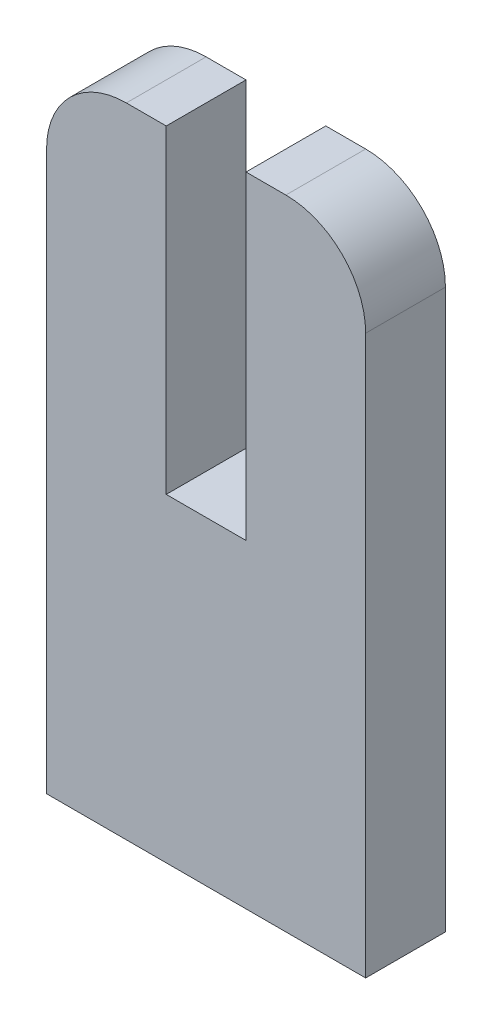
ISO-10303-21;
HEADER;
FILE_DESCRIPTION(('STEP AP214'),'2;1');
FILE_NAME('part.step','',(''),(''),'','','');
FILE_SCHEMA(('AUTOMOTIVE_DESIGN { 1 0 10303 214 1 1 1 1 }'));
ENDSEC;
DATA;
#1=APPLICATION_CONTEXT('core data for automotive mechanical design processes');
#2=APPLICATION_PROTOCOL_DEFINITION('international standard','automotive_design',2000,#1);
#3=PRODUCT_CONTEXT('',#1,'mechanical');
#4=PRODUCT('Part','Part','',(#3));
#5=PRODUCT_RELATED_PRODUCT_CATEGORY('part','',(#4));
#6=PRODUCT_DEFINITION_FORMATION('','',#4);
#7=PRODUCT_DEFINITION_CONTEXT('part definition',#1,'design');
#8=PRODUCT_DEFINITION('design','',#6,#7);
#9=PRODUCT_DEFINITION_SHAPE('','',#8);
#10=(LENGTH_UNIT() NAMED_UNIT(*) SI_UNIT(.MILLI.,.METRE.));
#11=(NAMED_UNIT(*) PLANE_ANGLE_UNIT() SI_UNIT($,.RADIAN.));
#12=(NAMED_UNIT(*) SI_UNIT($,.STERADIAN.) SOLID_ANGLE_UNIT());
#13=UNCERTAINTY_MEASURE_WITH_UNIT(LENGTH_MEASURE(1.E-05),#10,'distance_accuracy_value','');
#14=(GEOMETRIC_REPRESENTATION_CONTEXT(3) GLOBAL_UNCERTAINTY_ASSIGNED_CONTEXT((#13)) GLOBAL_UNIT_ASSIGNED_CONTEXT((#10,
#11,#12)) REPRESENTATION_CONTEXT('',''));
#15=CARTESIAN_POINT('',(0.,0.,0.));
#16=DIRECTION('',(0.,0.,1.));
#17=DIRECTION('',(1.,0.,0.));
#18=AXIS2_PLACEMENT_3D('',#15,#16,#17);
#19=CARTESIAN_POINT('',(-6.35,12.7,1.5875));
#20=DIRECTION('',(0.,-1.,0.));
#21=DIRECTION('',(0.,0.,-1.));
#22=AXIS2_PLACEMENT_3D('',#19,#20,#21);
#23=PLANE('',#22);
#24=DIRECTION('',(-1.,0.,0.));
#25=VECTOR('',#24,1.);
#26=CARTESIAN_POINT('',(-6.35,12.7,-1.5875));
#27=LINE('',#26,#25);
#28=CARTESIAN_POINT('',(-1.5875,12.7,-1.5875));
#29=VERTEX_POINT('',#28);
#30=CARTESIAN_POINT('',(-3.175,12.7,-1.5875));
#31=VERTEX_POINT('',#30);
#32=EDGE_CURVE('E131',#29,#31,#27,.T.);
#33=ORIENTED_EDGE('',*,*,#32,.T.);
#34=DIRECTION('',(0.,0.,-1.));
#35=VECTOR('',#34,1.);
#36=CARTESIAN_POINT('',(-3.175,12.7,1.5875));
#37=LINE('',#36,#35);
#38=CARTESIAN_POINT('',(-3.175,12.7,1.5875));
#39=VERTEX_POINT('',#38);
#40=EDGE_CURVE('E11',#31,#39,#37,.F.);
#41=ORIENTED_EDGE('',*,*,#40,.T.);
#42=DIRECTION('',(-1.,0.,0.));
#43=VECTOR('',#42,1.);
#44=CARTESIAN_POINT('',(-6.35,12.7,1.5875));
#45=LINE('',#44,#43);
#46=CARTESIAN_POINT('',(-1.5875,12.7,1.5875));
#47=VERTEX_POINT('',#46);
#48=EDGE_CURVE('E151',#47,#39,#45,.T.);
#49=ORIENTED_EDGE('',*,*,#48,.F.);
#50=DIRECTION('',(0.,0.,1.));
#51=VECTOR('',#50,1.);
#52=CARTESIAN_POINT('',(-1.5875,12.7,-1.5875));
#53=LINE('',#52,#51);
#54=EDGE_CURVE('E141',#29,#47,#53,.T.);
#55=ORIENTED_EDGE('',*,*,#54,.F.);
#56=EDGE_LOOP('',(#33,#41,#49,#55));
#57=FACE_BOUND('',#56,.T.);
#58=ADVANCED_FACE('F31',(#57),#23,.F.);
#59=CARTESIAN_POINT('',(6.35,12.7,1.5875));
#60=DIRECTION('',(-1.,0.,0.));
#61=DIRECTION('',(0.,-1.,0.));
#62=AXIS2_PLACEMENT_3D('',#59,#60,#61);
#63=PLANE('',#62);
#64=DIRECTION('',(0.,1.,0.));
#65=VECTOR('',#64,1.);
#66=CARTESIAN_POINT('',(6.35,12.7,-1.5875));
#67=LINE('',#66,#65);
#68=CARTESIAN_POINT('',(6.35,-12.7,-1.5875));
#69=VERTEX_POINT('',#68);
#70=CARTESIAN_POINT('',(6.35,9.52499999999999,-1.5875));
#71=VERTEX_POINT('',#70);
#72=EDGE_CURVE('E143',#69,#71,#67,.T.);
#73=ORIENTED_EDGE('',*,*,#72,.T.);
#74=DIRECTION('',(0.,0.,-1.));
#75=VECTOR('',#74,1.);
#76=CARTESIAN_POINT('',(6.35,9.52499999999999,1.5875));
#77=LINE('',#76,#75);
#78=CARTESIAN_POINT('',(6.35,9.52499999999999,1.5875));
#79=VERTEX_POINT('',#78);
#80=EDGE_CURVE('E179',#71,#79,#77,.F.);
#81=ORIENTED_EDGE('',*,*,#80,.T.);
#82=DIRECTION('',(0.,1.,0.));
#83=VECTOR('',#82,1.);
#84=CARTESIAN_POINT('',(6.35,12.7,1.5875));
#85=LINE('',#84,#83);
#86=CARTESIAN_POINT('',(6.35,-12.7,1.5875));
#87=VERTEX_POINT('',#86);
#88=EDGE_CURVE('E148',#87,#79,#85,.T.);
#89=ORIENTED_EDGE('',*,*,#88,.F.);
#90=DIRECTION('',(0.,0.,-1.));
#91=VECTOR('',#90,1.);
#92=CARTESIAN_POINT('',(6.35,-12.7,1.5875));
#93=LINE('',#92,#91);
#94=EDGE_CURVE('E159',#87,#69,#93,.T.);
#95=ORIENTED_EDGE('',*,*,#94,.T.);
#96=EDGE_LOOP('',(#73,#81,#89,#95));
#97=FACE_BOUND('',#96,.T.);
#98=ADVANCED_FACE('F198',(#97),#63,.F.);
#99=CARTESIAN_POINT('',(3.175,12.7,1.5875));
#100=VERTEX_POINT('',#99);
#101=CARTESIAN_POINT('',(1.5875,12.7,1.5875));
#102=VERTEX_POINT('',#101);
#103=EDGE_CURVE('E153',#100,#102,#45,.T.);
#104=ORIENTED_EDGE('',*,*,#103,.F.);
#105=DIRECTION('',(0.,0.,-1.));
#106=VECTOR('',#105,1.);
#107=CARTESIAN_POINT('',(3.175,12.7,1.5875));
#108=LINE('',#107,#106);
#109=CARTESIAN_POINT('',(3.175,12.7,-1.5875));
#110=VERTEX_POINT('',#109);
#111=EDGE_CURVE('E172',#100,#110,#108,.T.);
#112=ORIENTED_EDGE('',*,*,#111,.T.);
#113=CARTESIAN_POINT('',(1.5875,12.7,-1.5875));
#114=VERTEX_POINT('',#113);
#115=EDGE_CURVE('E162',#110,#114,#27,.T.);
#116=ORIENTED_EDGE('',*,*,#115,.T.);
#117=DIRECTION('',(0.,0.,1.));
#118=VECTOR('',#117,1.);
#119=CARTESIAN_POINT('',(1.5875,12.7,-1.5875));
#120=LINE('',#119,#118);
#121=EDGE_CURVE('E144',#114,#102,#120,.T.);
#122=ORIENTED_EDGE('',*,*,#121,.T.);
#123=EDGE_LOOP('',(#104,#112,#116,#122));
#124=FACE_BOUND('',#123,.T.);
#125=ADVANCED_FACE('F207',(#124),#23,.F.);
#126=CARTESIAN_POINT('',(-6.35,12.7,1.5875));
#127=DIRECTION('',(1.,0.,0.));
#128=DIRECTION('',(0.,1.,0.));
#129=AXIS2_PLACEMENT_3D('',#126,#127,#128);
#130=PLANE('',#129);
#131=DIRECTION('',(0.,-1.,0.));
#132=VECTOR('',#131,1.);
#133=CARTESIAN_POINT('',(-6.35,12.7,1.5875));
#134=LINE('',#133,#132);
#135=CARTESIAN_POINT('',(-6.35,9.52499999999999,1.5875));
#136=VERTEX_POINT('',#135);
#137=CARTESIAN_POINT('',(-6.35,-12.7,1.5875));
#138=VERTEX_POINT('',#137);
#139=EDGE_CURVE('E155',#136,#138,#134,.T.);
#140=ORIENTED_EDGE('',*,*,#139,.F.);
#141=DIRECTION('',(0.,0.,-1.));
#142=VECTOR('',#141,1.);
#143=CARTESIAN_POINT('',(-6.35,9.52499999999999,1.5875));
#144=LINE('',#143,#142);
#145=CARTESIAN_POINT('',(-6.35,9.52499999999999,-1.5875));
#146=VERTEX_POINT('',#145);
#147=EDGE_CURVE('E39',#136,#146,#144,.T.);
#148=ORIENTED_EDGE('',*,*,#147,.T.);
#149=DIRECTION('',(0.,-1.,0.));
#150=VECTOR('',#149,1.);
#151=CARTESIAN_POINT('',(-6.35,12.7,-1.5875));
#152=LINE('',#151,#150);
#153=CARTESIAN_POINT('',(-6.35,-12.7,-1.5875));
#154=VERTEX_POINT('',#153);
#155=EDGE_CURVE('E164',#146,#154,#152,.T.);
#156=ORIENTED_EDGE('',*,*,#155,.T.);
#157=DIRECTION('',(0.,0.,-1.));
#158=VECTOR('',#157,1.);
#159=CARTESIAN_POINT('',(-6.35,-12.7,1.5875));
#160=LINE('',#159,#158);
#161=EDGE_CURVE('E169',#138,#154,#160,.T.);
#162=ORIENTED_EDGE('',*,*,#161,.F.);
#163=EDGE_LOOP('',(#140,#148,#156,#162));
#164=FACE_BOUND('',#163,.T.);
#165=ADVANCED_FACE('F187',(#164),#130,.F.);
#166=CARTESIAN_POINT('',(-6.35,-12.7,1.5875));
#167=DIRECTION('',(0.,1.,0.));
#168=DIRECTION('',(0.,0.,1.));
#169=AXIS2_PLACEMENT_3D('',#166,#167,#168);
#170=PLANE('',#169);
#171=DIRECTION('',(1.,0.,0.));
#172=VECTOR('',#171,1.);
#173=CARTESIAN_POINT('',(-6.35,-12.7,-1.5875));
#174=LINE('',#173,#172);
#175=EDGE_CURVE('E152',#154,#69,#174,.T.);
#176=ORIENTED_EDGE('',*,*,#175,.T.);
#177=ORIENTED_EDGE('',*,*,#94,.F.);
#178=DIRECTION('',(1.,0.,0.));
#179=VECTOR('',#178,1.);
#180=CARTESIAN_POINT('',(-6.35,-12.7,1.5875));
#181=LINE('',#180,#179);
#182=EDGE_CURVE('E157',#138,#87,#181,.T.);
#183=ORIENTED_EDGE('',*,*,#182,.F.);
#184=ORIENTED_EDGE('',*,*,#161,.T.);
#185=EDGE_LOOP('',(#176,#177,#183,#184));
#186=FACE_BOUND('',#185,.T.);
#187=ADVANCED_FACE('F194',(#186),#170,.F.);
#188=CARTESIAN_POINT('',(6.35,-12.7,1.5875));
#189=DIRECTION('',(0.,0.,1.));
#190=DIRECTION('',(1.,0.,0.));
#191=AXIS2_PLACEMENT_3D('',#188,#189,#190);
#192=PLANE('',#191);
#193=ORIENTED_EDGE('',*,*,#88,.T.);
#194=CARTESIAN_POINT('',(3.175,9.52499999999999,1.5875));
#195=DIRECTION('',(0.,0.,1.));
#196=DIRECTION('',(1.,0.,0.));
#197=AXIS2_PLACEMENT_3D('',#194,#195,#196);
#198=CIRCLE('',#197,3.175);
#199=EDGE_CURVE('E182',#79,#100,#198,.T.);
#200=ORIENTED_EDGE('',*,*,#199,.T.);
#201=ORIENTED_EDGE('',*,*,#103,.T.);
#202=DIRECTION('',(0.,1.,0.));
#203=VECTOR('',#202,1.);
#204=CARTESIAN_POINT('',(1.5875,12.7,1.5875));
#205=LINE('',#204,#203);
#206=CARTESIAN_POINT('',(1.5875,0.,1.5875));
#207=VERTEX_POINT('',#206);
#208=EDGE_CURVE('E132',#207,#102,#205,.T.);
#209=ORIENTED_EDGE('',*,*,#208,.F.);
#210=DIRECTION('',(1.,0.,0.));
#211=VECTOR('',#210,1.);
#212=CARTESIAN_POINT('',(-1.5875,0.,1.5875));
#213=LINE('',#212,#211);
#214=CARTESIAN_POINT('',(-1.5875,0.,1.5875));
#215=VERTEX_POINT('',#214);
#216=EDGE_CURVE('E135',#215,#207,#213,.T.);
#217=ORIENTED_EDGE('',*,*,#216,.F.);
#218=DIRECTION('',(0.,-1.,0.));
#219=VECTOR('',#218,1.);
#220=CARTESIAN_POINT('',(-1.5875,12.7,1.5875));
#221=LINE('',#220,#219);
#222=EDGE_CURVE('E114',#47,#215,#221,.T.);
#223=ORIENTED_EDGE('',*,*,#222,.F.);
#224=ORIENTED_EDGE('',*,*,#48,.T.);
#225=CARTESIAN_POINT('',(-3.175,9.52499999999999,1.5875));
#226=DIRECTION('',(0.,0.,1.));
#227=DIRECTION('',(1.,0.,0.));
#228=AXIS2_PLACEMENT_3D('',#225,#226,#227);
#229=CIRCLE('',#228,3.175);
#230=EDGE_CURVE('E46',#39,#136,#229,.T.);
#231=ORIENTED_EDGE('',*,*,#230,.T.);
#232=ORIENTED_EDGE('',*,*,#139,.T.);
#233=ORIENTED_EDGE('',*,*,#182,.T.);
#234=EDGE_LOOP('',(#193,#200,#201,#209,#217,#223,#224,#231,#232,#233));
#235=FACE_BOUND('',#234,.T.);
#236=ADVANCED_FACE('F201',(#235),#192,.T.);
#237=CARTESIAN_POINT('',(6.35,-12.7,-1.5875));
#238=DIRECTION('',(0.,0.,1.));
#239=DIRECTION('',(1.,0.,0.));
#240=AXIS2_PLACEMENT_3D('',#237,#238,#239);
#241=PLANE('',#240);
#242=ORIENTED_EDGE('',*,*,#115,.F.);
#243=CARTESIAN_POINT('',(3.175,9.52499999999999,-1.5875));
#244=DIRECTION('',(0.,0.,1.));
#245=DIRECTION('',(1.,0.,0.));
#246=AXIS2_PLACEMENT_3D('',#243,#244,#245);
#247=CIRCLE('',#246,3.175);
#248=EDGE_CURVE('E177',#110,#71,#247,.F.);
#249=ORIENTED_EDGE('',*,*,#248,.T.);
#250=ORIENTED_EDGE('',*,*,#72,.F.);
#251=ORIENTED_EDGE('',*,*,#175,.F.);
#252=ORIENTED_EDGE('',*,*,#155,.F.);
#253=CARTESIAN_POINT('',(-3.175,9.52499999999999,-1.5875));
#254=DIRECTION('',(0.,0.,1.));
#255=DIRECTION('',(1.,0.,0.));
#256=AXIS2_PLACEMENT_3D('',#253,#254,#255);
#257=CIRCLE('',#256,3.175);
#258=EDGE_CURVE('E175',#146,#31,#257,.F.);
#259=ORIENTED_EDGE('',*,*,#258,.T.);
#260=ORIENTED_EDGE('',*,*,#32,.F.);
#261=DIRECTION('',(0.,-1.,0.));
#262=VECTOR('',#261,1.);
#263=CARTESIAN_POINT('',(-1.5875,12.7,-1.5875));
#264=LINE('',#263,#262);
#265=CARTESIAN_POINT('',(-1.5875,0.,-1.5875));
#266=VERTEX_POINT('',#265);
#267=EDGE_CURVE('E111',#29,#266,#264,.T.);
#268=ORIENTED_EDGE('',*,*,#267,.T.);
#269=DIRECTION('',(1.,0.,0.));
#270=VECTOR('',#269,1.);
#271=CARTESIAN_POINT('',(-1.5875,0.,-1.5875));
#272=LINE('',#271,#270);
#273=CARTESIAN_POINT('',(1.5875,0.,-1.5875));
#274=VERTEX_POINT('',#273);
#275=EDGE_CURVE('E123',#266,#274,#272,.T.);
#276=ORIENTED_EDGE('',*,*,#275,.T.);
#277=DIRECTION('',(0.,1.,0.));
#278=VECTOR('',#277,1.);
#279=CARTESIAN_POINT('',(1.5875,12.7,-1.5875));
#280=LINE('',#279,#278);
#281=EDGE_CURVE('E119',#274,#114,#280,.T.);
#282=ORIENTED_EDGE('',*,*,#281,.T.);
#283=EDGE_LOOP('',(#242,#249,#250,#251,#252,#259,#260,#268,#276,#282));
#284=FACE_BOUND('',#283,.T.);
#285=ADVANCED_FACE('F130',(#284),#241,.F.);
#286=CARTESIAN_POINT('',(-1.5875,12.7,-1.5875));
#287=DIRECTION('',(-1.,0.,0.));
#288=DIRECTION('',(0.,-1.,0.));
#289=AXIS2_PLACEMENT_3D('',#286,#287,#288);
#290=PLANE('',#289);
#291=ORIENTED_EDGE('',*,*,#222,.T.);
#292=DIRECTION('',(0.,0.,1.));
#293=VECTOR('',#292,1.);
#294=CARTESIAN_POINT('',(-1.5875,0.,-1.5875));
#295=LINE('',#294,#293);
#296=EDGE_CURVE('E107',#266,#215,#295,.T.);
#297=ORIENTED_EDGE('',*,*,#296,.F.);
#298=ORIENTED_EDGE('',*,*,#267,.F.);
#299=ORIENTED_EDGE('',*,*,#54,.T.);
#300=EDGE_LOOP('',(#291,#297,#298,#299));
#301=FACE_BOUND('',#300,.T.);
#302=ADVANCED_FACE('F109',(#301),#290,.F.);
#303=CARTESIAN_POINT('',(1.5875,12.7,-1.5875));
#304=DIRECTION('',(1.,0.,0.));
#305=DIRECTION('',(0.,1.,0.));
#306=AXIS2_PLACEMENT_3D('',#303,#304,#305);
#307=PLANE('',#306);
#308=ORIENTED_EDGE('',*,*,#208,.T.);
#309=ORIENTED_EDGE('',*,*,#121,.F.);
#310=ORIENTED_EDGE('',*,*,#281,.F.);
#311=DIRECTION('',(0.,0.,1.));
#312=VECTOR('',#311,1.);
#313=CARTESIAN_POINT('',(1.5875,0.,-1.5875));
#314=LINE('',#313,#312);
#315=EDGE_CURVE('E118',#274,#207,#314,.T.);
#316=ORIENTED_EDGE('',*,*,#315,.T.);
#317=EDGE_LOOP('',(#308,#309,#310,#316));
#318=FACE_BOUND('',#317,.T.);
#319=ADVANCED_FACE('F210',(#318),#307,.F.);
#320=CARTESIAN_POINT('',(-1.5875,0.,-1.5875));
#321=DIRECTION('',(0.,-1.,0.));
#322=DIRECTION('',(0.,0.,-1.));
#323=AXIS2_PLACEMENT_3D('',#320,#321,#322);
#324=PLANE('',#323);
#325=ORIENTED_EDGE('',*,*,#216,.T.);
#326=ORIENTED_EDGE('',*,*,#315,.F.);
#327=ORIENTED_EDGE('',*,*,#275,.F.);
#328=ORIENTED_EDGE('',*,*,#296,.T.);
#329=EDGE_LOOP('',(#325,#326,#327,#328));
#330=FACE_BOUND('',#329,.T.);
#331=ADVANCED_FACE('F124',(#330),#324,.F.);
#332=CARTESIAN_POINT('',(3.175,9.52499999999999,1.5875));
#333=DIRECTION('',(0.,0.,-1.));
#334=DIRECTION('',(-1.,0.,0.));
#335=AXIS2_PLACEMENT_3D('',#332,#333,#334);
#336=CYLINDRICAL_SURFACE('',#335,3.175);
#337=ORIENTED_EDGE('',*,*,#199,.F.);
#338=ORIENTED_EDGE('',*,*,#80,.F.);
#339=ORIENTED_EDGE('',*,*,#248,.F.);
#340=ORIENTED_EDGE('',*,*,#111,.F.);
#341=EDGE_LOOP('',(#337,#338,#339,#340));
#342=FACE_BOUND('',#341,.T.);
#343=ADVANCED_FACE('F205',(#342),#336,.T.);
#344=CARTESIAN_POINT('',(-3.175,9.52499999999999,1.5875));
#345=DIRECTION('',(0.,0.,-1.));
#346=DIRECTION('',(-1.,0.,0.));
#347=AXIS2_PLACEMENT_3D('',#344,#345,#346);
#348=CYLINDRICAL_SURFACE('',#347,3.175);
#349=ORIENTED_EDGE('',*,*,#230,.F.);
#350=ORIENTED_EDGE('',*,*,#40,.F.);
#351=ORIENTED_EDGE('',*,*,#258,.F.);
#352=ORIENTED_EDGE('',*,*,#147,.F.);
#353=EDGE_LOOP('',(#349,#350,#351,#352));
#354=FACE_BOUND('',#353,.T.);
#355=ADVANCED_FACE('F33',(#354),#348,.T.);
#356=CLOSED_SHELL('',(#58,#98,#125,#165,#187,#236,#285,#302,#319,#331,#343,#355));
#357=MANIFOLD_SOLID_BREP('B2',#356);
#358=ADVANCED_BREP_SHAPE_REPRESENTATION('',(#18,#357),#14);
#359=SHAPE_DEFINITION_REPRESENTATION(#9,#358);
ENDSEC;
END-ISO-10303-21;
